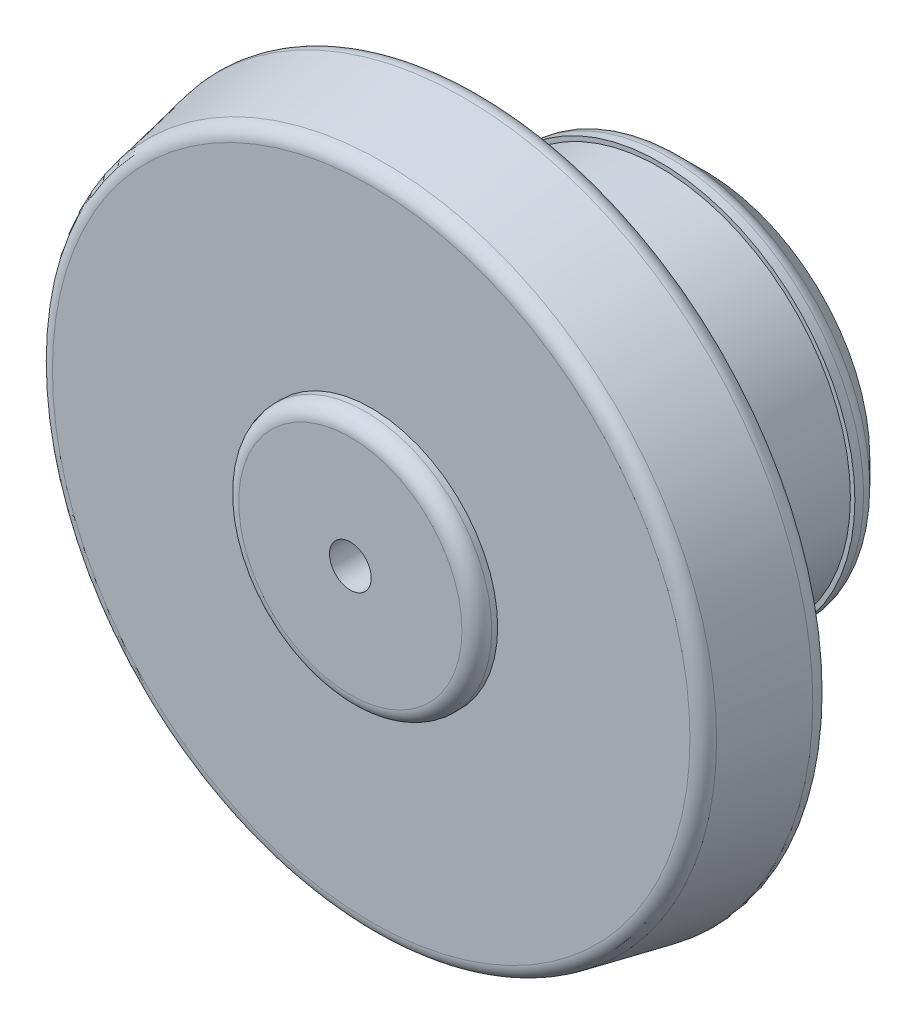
from build123d import *

# Parameters (mm, degrees)
ESQUISSE1_R                  = 6.55
EXTRUSION1_DEPTH             = 1.5
ESQUISSE2_R                  = 6.4
EXTRUSION2_DEPTH             = 6
CHANFREIN1_SIZE              = 1
ESQUISSE3_R                  = 11.85
EXTRUSION3_DEPTH             = 3.7
ESQUISSE4_R                  = 4.25
EXTRUSION4_DEPTH             = 0.7
CONG_1_R                     = 0.5
ESQUISSE8_R                  = 5
ENL_V_MAT_EXTRU_2_DEPTH      = 7
ESQUISSE9_R                  = 2
EXTRUSION5_DEPTH             = 6
ESQUISSE7_R                  = 0.7
ENL_V_MAT_EXTRU_1_DEPTH      = 21.429246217
ESQUISSE10_W                 = 3.435279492
ESQUISSE10_H                 = 5.375201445
EXTRUSION6_DEPTH             = 0.15
R_P_TITION_CIRCULAIRE1_COUNT = 4


with BuildPart() as part:
    # Esquisse1 → Extrusion1 (new body)
    with BuildSketch(Plane.XY):
        Circle(ESQUISSE1_R)
    extrude(amount=EXTRUSION1_DEPTH)

    # Esquisse2 → Extrusion2 (add)
    with BuildSketch(Plane.XY.offset(1.5)):
        Circle(ESQUISSE2_R)
    extrude(amount=EXTRUSION2_DEPTH)

    # Chanfrein1
    chanfrein1_edges = [part.edges().sort_by_distance(p)[0] for p in [
        (-6.55, 0, 0),
    ]]
    chamfer(chanfrein1_edges, length=CHANFREIN1_SIZE)

    # Esquisse3 → Extrusion3 (add)
    with BuildSketch(Plane.XY.offset(7.5)):
        Circle(ESQUISSE3_R)
    extrude(amount=EXTRUSION3_DEPTH)

    # Esquisse4 → Extrusion4 (add)
    with BuildSketch(Plane.XY.offset(11.2)):
        Circle(ESQUISSE4_R)
    extrude(amount=EXTRUSION4_DEPTH)

    # Esquisse6 → Enl_vement de mati_re-R_volution1 (revolve, cut)
    with BuildSketch(Plane(origin=(0, 0, 0), x_dir=(1, 0, 0), z_dir=(0, 1, 0))):
        Polygon((-13.252434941, -3.770168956), (-6.4, -3.770168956), (-6.4, -8.95), (-9.6, -8.95), (-9.6, -7.5), (-11.85, -7.5), (-11.121117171, -11.2), (-13.252434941, -11.2), align=None)
    revolve(axis=Axis((0, 0, -80.9), (0, 0, 1)), mode=Mode.SUBTRACT)

    # Cong_1
    cong_1_edges = [part.edges().sort_by_distance(p)[0] for p in [
        (-4.25, 0, 11.9),
        (11.121117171, 0, 11.2),
        (11.85, 0, 7.5),
        (-6.55, 0, 1),
    ]]
    fillet(cong_1_edges, radius=CONG_1_R)

    # Esquisse8 → Enl_v. mat.-Extru.2 (cut)
    with BuildSketch(Plane(origin=(0, 0, 0), x_dir=(-1, 0, 0), z_dir=(0, 0, -1))):
        Circle(ESQUISSE8_R)
    extrude(amount=-ENL_V_MAT_EXTRU_2_DEPTH, mode=Mode.SUBTRACT)

    # Esquisse9 → Extrusion5 (add)
    with BuildSketch(Plane(origin=(0, 0, 7), x_dir=(-1, 0, 0), z_dir=(0, 0, -1))):
        Circle(ESQUISSE9_R)
    extrude(amount=EXTRUSION5_DEPTH)

    # Esquisse7 → Enl_v. mat.-Extru.1 (cut, through all)
    with BuildSketch(Plane(origin=(0, 0, 0), x_dir=(-1, 0, 0), z_dir=(0, 0, -1))):
        Circle(ESQUISSE7_R)
    extrude(amount=-ENL_V_MAT_EXTRU_1_DEPTH, mode=Mode.SUBTRACT)

    # Esquisse10 → Extrusion6 (add, symmetric)
    with BuildSketch(Plane(origin=(0, 0, 0), x_dir=(1, 0, 0), z_dir=(0, 1, 0))):
        with Locations((3.453870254, -4.347689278)):
            Rectangle(ESQUISSE10_W, ESQUISSE10_H)
    extrusion6 = extrude(amount=EXTRUSION6_DEPTH, both=True)

    # R_p_tition circulaire1: Extrusion6 ×4 about axis
    r_p_tition_circulaire1_axis = Axis((0, 0, 0), (0, 0, 1))
    for i in range(1, R_P_TITION_CIRCULAIRE1_COUNT):
        add(extrusion6.rotate(r_p_tition_circulaire1_axis, i * 360 / R_P_TITION_CIRCULAIRE1_COUNT))


solid = part.part
